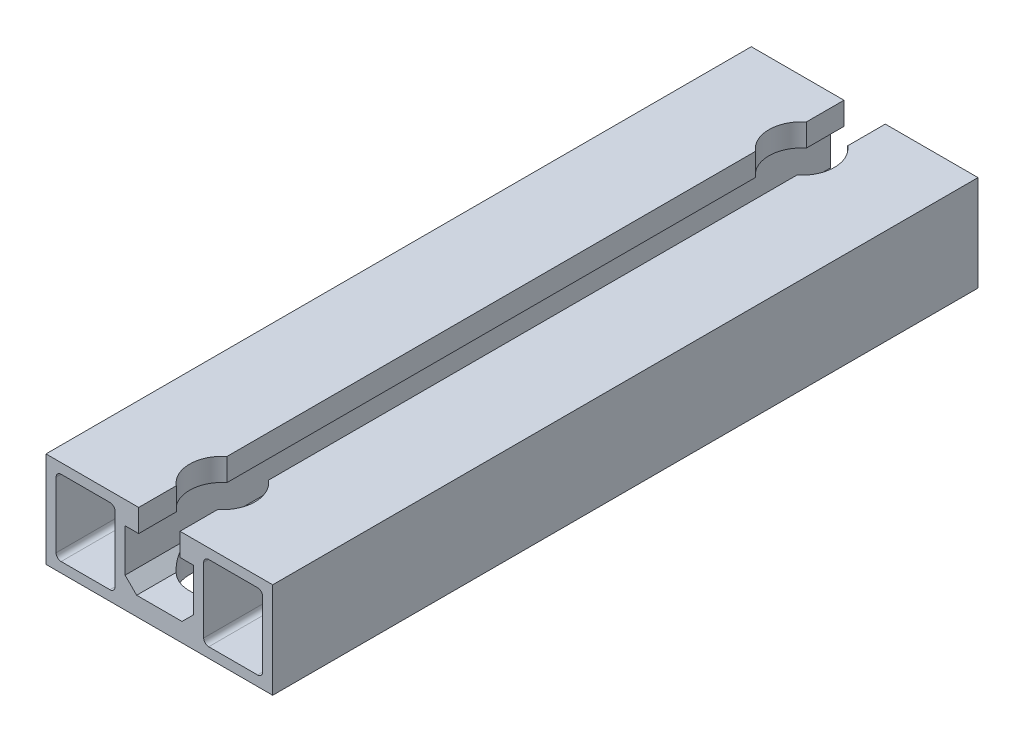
from build123d import *

# Parameters (mm, degrees)
EXTRUDE1_DEPTH      = 70
EXTRUDE1_DEPTH_BACK = 70
SKETCH3_R           = 6.5
EXTRUDE2_DEPTH      = 70


with BuildPart() as part:
    # Sketch1 → Extrude1 (new, two sides: drawn at the far end of the back side and taken through both)
    with BuildSketch(Plane.XY.offset(-EXTRUDE1_DEPTH_BACK)):
        Polygon((-22.5, 9.5), (-22.5, -9.5), (22.5, -9.5), (22.5, 9.5), (4.1, 9.5), (4.1, 5), (6.8, 5), (6.8, -3.5), (4.5, -5.8), (-4.5, -5.8), (-6.8, -3.5), (-6.8, 5), (-4.1, 5), (-4.1, 9.5), align=None)
        with BuildLine():
            Line((19.5, -7.5), (9.8, -7.5))
            ThreePointArc((9.8, -7.5), (9.092893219, -7.207106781), (8.8, -6.5))
            Line((8.8, -6.5), (8.8, 6.5))
            ThreePointArc((8.8, 6.5), (9.092893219, 7.207106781), (9.8, 7.5))
            Line((9.8, 7.5), (19.5, 7.5))
            ThreePointArc((19.5, 7.5), (20.207106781, 7.207106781), (20.5, 6.5))
            Line((20.5, 6.5), (20.5, -6.5))
            ThreePointArc((20.5, -6.5), (20.207106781, -7.207106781), (19.5, -7.5))
        make_face(mode=Mode.SUBTRACT)
        with BuildLine():
            Line((-8.8, 6.5), (-8.8, -6.5))
            ThreePointArc((-8.8, -6.5), (-9.092893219, -7.207106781), (-9.8, -7.5))
            Line((-9.8, -7.5), (-19.5, -7.5))
            ThreePointArc((-19.5, -7.5), (-20.207106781, -7.207106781), (-20.5, -6.5))
            Line((-20.5, -6.5), (-20.5, 6.5))
            ThreePointArc((-20.5, 6.5), (-20.207106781, 7.207106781), (-19.5, 7.5))
            Line((-19.5, 7.5), (-9.8, 7.5))
            ThreePointArc((-9.8, 7.5), (-9.092893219, 7.207106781), (-8.8, 6.5))
        make_face(mode=Mode.SUBTRACT)
    extrude(amount=EXTRUDE1_DEPTH + EXTRUDE1_DEPTH_BACK)

    # Sketch3 → Extrude2 (cut)
    with BuildSketch(Plane.XZ.offset(9.5)):
        with Locations(Location((0, 57.500000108, 0), (0, 0, 270))):
            Circle(SKETCH3_R)
        with Locations(Location((0, -57.5, 0), (0, 0, 270))):
            Circle(SKETCH3_R)
    extrude(amount=-EXTRUDE2_DEPTH, mode=Mode.SUBTRACT)


solid = part.part
